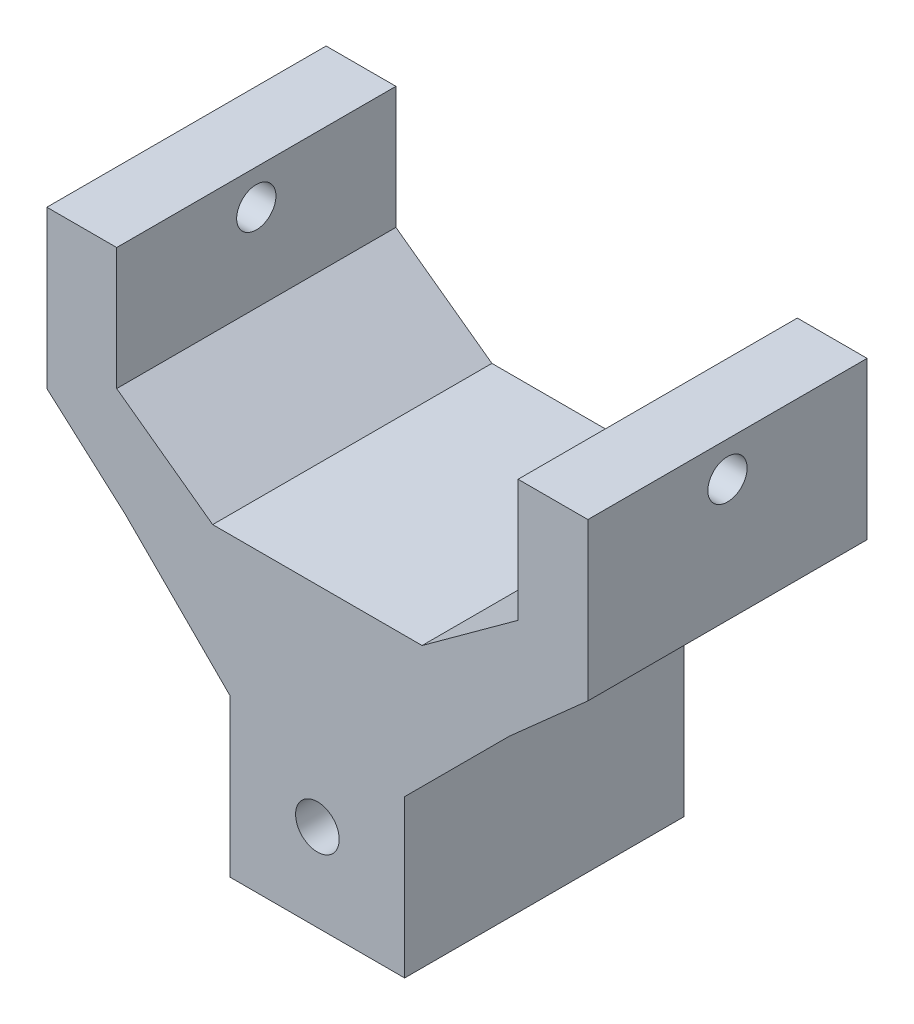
from build123d import *

# Parameters (mm, degrees)
ARM_END_U_ADAPTER_DEPTH                = 16
SKETCH_6_R                             = 2.5
ARM_END_PIN_D5_DEPTH                   = 250
SKETCH_7_R                             = 2.25
STATOR_SIDE_SCREW_CLEARANCE_D4_5_DEPTH = 250


with BuildPart() as part:
    # Sketch 5 → Arm_End_U_Adapter (new, symmetric)
    with BuildSketch(Plane.XY):
        Polygon((-10, -150), (10, -150), (10, -132), (22, -120), (31, -112), (31, -94), (23, -94), (23, -108), (12, -116), (-12, -116), (-23, -108), (-23, -94), (-31, -94), (-31, -112), (-22, -120), (-10, -132), align=None)
    extrude(amount=ARM_END_U_ADAPTER_DEPTH, both=True)

    # Sketch 6 → Arm_End_Pin_D5 (cut, symmetric)
    with BuildSketch(Plane.XY):
        with Locations((0, -140)):
            Circle(SKETCH_6_R)
    extrude(amount=ARM_END_PIN_D5_DEPTH, both=True, mode=Mode.SUBTRACT)

    # Sketch 7 → Stator_Side_Screw_Clearance_D4_5 (cut, symmetric)
    with BuildSketch(Plane(origin=(0, 0, 0), x_dir=(0, 0, -1), z_dir=(1, 0, 0))):
        with Locations((0, -98)):
            Circle(SKETCH_7_R)
    extrude(amount=STATOR_SIDE_SCREW_CLEARANCE_D4_5_DEPTH, both=True, mode=Mode.SUBTRACT)


solid = part.part
